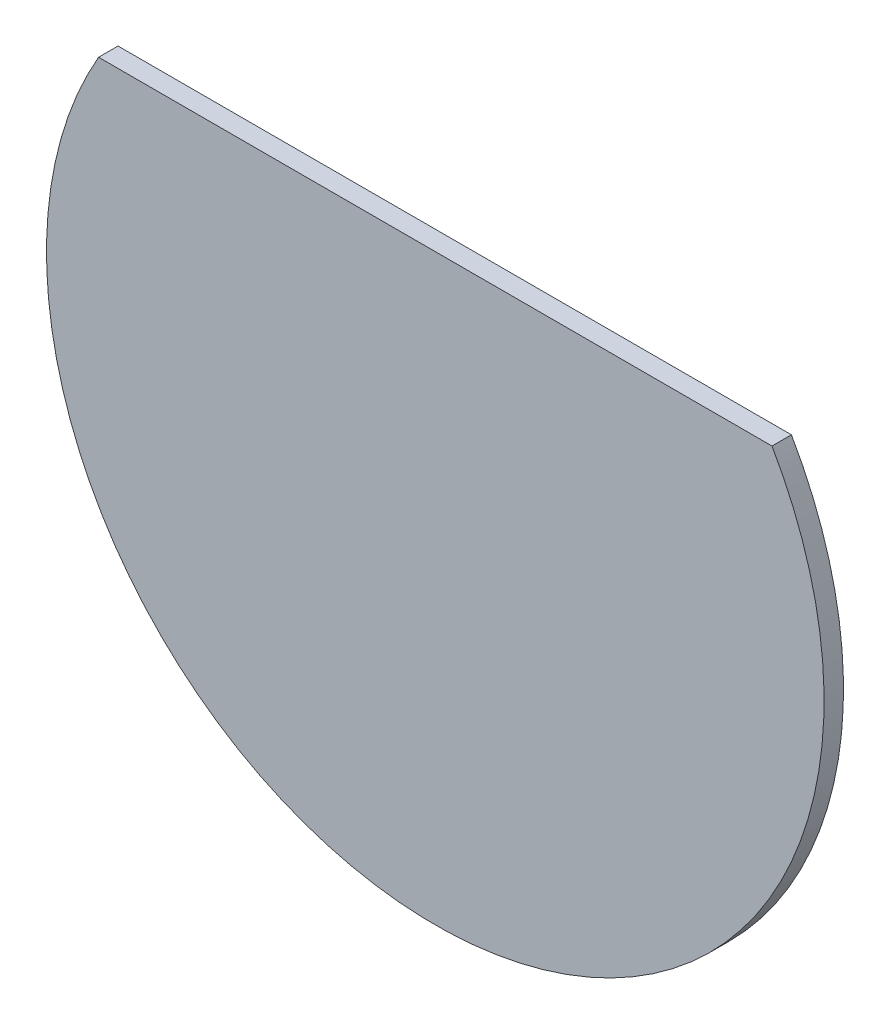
from build123d import *

# Parameters (mm, degrees)
BOSS_EXTRUDE1_DEPTH = 6.35


with BuildPart() as part:
    # Sketch1 → Boss-Extrude1 (new body)
    with BuildSketch(Plane.XY):
        with BuildLine():
            Line((-109.985226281, 63.5), (109.985226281, 63.5))
            ThreePointArc((109.985226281, 63.5), (0, -127), (-109.985226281, 63.5))
        make_face()
    extrude(amount=BOSS_EXTRUDE1_DEPTH)


solid = part.part
